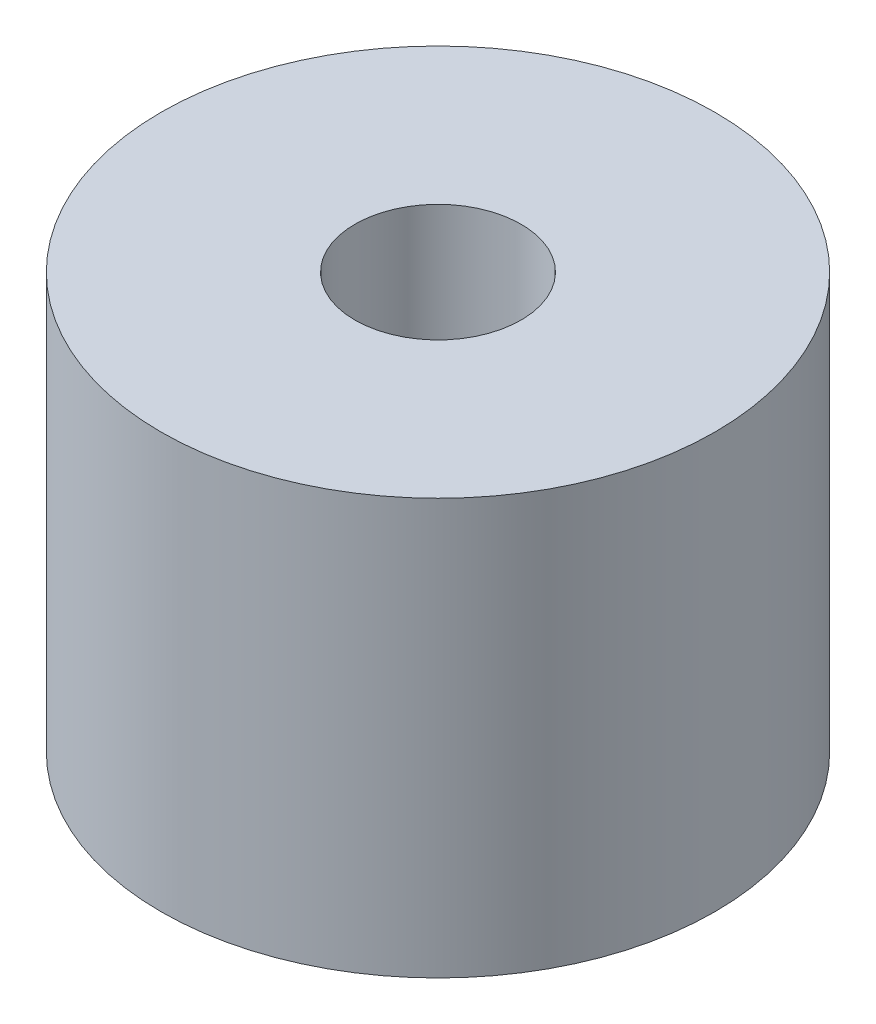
ISO-10303-21;
HEADER;
FILE_DESCRIPTION(('STEP AP214'),'2;1');
FILE_NAME('part.step','',(''),(''),'','','');
FILE_SCHEMA(('AUTOMOTIVE_DESIGN { 1 0 10303 214 1 1 1 1 }'));
ENDSEC;
DATA;
#1=APPLICATION_CONTEXT('core data for automotive mechanical design processes');
#2=APPLICATION_PROTOCOL_DEFINITION('international standard','automotive_design',2000,#1);
#3=PRODUCT_CONTEXT('',#1,'mechanical');
#4=PRODUCT('Part','Part','',(#3));
#5=PRODUCT_RELATED_PRODUCT_CATEGORY('part','',(#4));
#6=PRODUCT_DEFINITION_FORMATION('','',#4);
#7=PRODUCT_DEFINITION_CONTEXT('part definition',#1,'design');
#8=PRODUCT_DEFINITION('design','',#6,#7);
#9=PRODUCT_DEFINITION_SHAPE('','',#8);
#10=(LENGTH_UNIT() NAMED_UNIT(*) SI_UNIT(.MILLI.,.METRE.));
#11=(NAMED_UNIT(*) PLANE_ANGLE_UNIT() SI_UNIT($,.RADIAN.));
#12=(NAMED_UNIT(*) SI_UNIT($,.STERADIAN.) SOLID_ANGLE_UNIT());
#13=UNCERTAINTY_MEASURE_WITH_UNIT(LENGTH_MEASURE(1.E-05),#10,'distance_accuracy_value','');
#14=(GEOMETRIC_REPRESENTATION_CONTEXT(3) GLOBAL_UNCERTAINTY_ASSIGNED_CONTEXT((#13)) GLOBAL_UNIT_ASSIGNED_CONTEXT((#10,
#11,#12)) REPRESENTATION_CONTEXT('',''));
#15=CARTESIAN_POINT('',(0.,0.,0.));
#16=DIRECTION('',(0.,0.,1.));
#17=DIRECTION('',(1.,0.,0.));
#18=AXIS2_PLACEMENT_3D('',#15,#16,#17);
#19=CARTESIAN_POINT('',(0.,15.,0.));
#20=DIRECTION('',(0.,-1.,0.));
#21=DIRECTION('',(0.,0.,-1.));
#22=AXIS2_PLACEMENT_3D('',#19,#20,#21);
#23=CYLINDRICAL_SURFACE('',#22,10.);
#24=CARTESIAN_POINT('',(0.,15.,0.));
#25=DIRECTION('',(0.,1.,0.));
#26=DIRECTION('',(0.,0.,1.));
#27=AXIS2_PLACEMENT_3D('',#24,#25,#26);
#28=CIRCLE('',#27,10.);
#29=CARTESIAN_POINT('',(0.,15.,10.));
#30=VERTEX_POINT('',#29);
#31=EDGE_CURVE('E10',#30,#30,#28,.T.);
#32=ORIENTED_EDGE('',*,*,#31,.F.);
#33=EDGE_LOOP('',(#32));
#34=FACE_BOUND('',#33,.T.);
#35=CARTESIAN_POINT('',(0.,0.,0.));
#36=DIRECTION('',(0.,1.,0.));
#37=DIRECTION('',(0.,0.,1.));
#38=AXIS2_PLACEMENT_3D('',#35,#36,#37);
#39=CIRCLE('',#38,10.);
#40=CARTESIAN_POINT('',(0.,0.,10.));
#41=VERTEX_POINT('',#40);
#42=EDGE_CURVE('E18',#41,#41,#39,.T.);
#43=ORIENTED_EDGE('',*,*,#42,.T.);
#44=EDGE_LOOP('',(#43));
#45=FACE_BOUND('',#44,.T.);
#46=ADVANCED_FACE('F15',(#34,#45),#23,.T.);
#47=CARTESIAN_POINT('',(0.,15.,0.));
#48=DIRECTION('',(0.,1.,0.));
#49=DIRECTION('',(0.,0.,1.));
#50=AXIS2_PLACEMENT_3D('',#47,#48,#49);
#51=PLANE('',#50);
#52=CARTESIAN_POINT('',(0.,15.,0.));
#53=DIRECTION('',(0.,1.,0.));
#54=DIRECTION('',(0.,0.,1.));
#55=AXIS2_PLACEMENT_3D('',#52,#53,#54);
#56=CIRCLE('',#55,3.);
#57=CARTESIAN_POINT('',(0.,15.,3.));
#58=VERTEX_POINT('',#57);
#59=EDGE_CURVE('E34',#58,#58,#56,.T.);
#60=ORIENTED_EDGE('',*,*,#59,.F.);
#61=EDGE_LOOP('',(#60));
#62=FACE_BOUND('',#61,.T.);
#63=ORIENTED_EDGE('',*,*,#31,.T.);
#64=EDGE_LOOP('',(#63));
#65=FACE_BOUND('',#64,.T.);
#66=ADVANCED_FACE('F42',(#62,#65),#51,.T.);
#67=CARTESIAN_POINT('',(0.,0.,0.));
#68=DIRECTION('',(0.,1.,0.));
#69=DIRECTION('',(0.,0.,1.));
#70=AXIS2_PLACEMENT_3D('',#67,#68,#69);
#71=PLANE('',#70);
#72=ORIENTED_EDGE('',*,*,#42,.F.);
#73=EDGE_LOOP('',(#72));
#74=FACE_BOUND('',#73,.T.);
#75=ADVANCED_FACE('F28',(#74),#71,.F.);
#76=CARTESIAN_POINT('',(0.,5.,0.));
#77=DIRECTION('',(0.,1.,0.));
#78=DIRECTION('',(0.,0.,1.));
#79=AXIS2_PLACEMENT_3D('',#76,#77,#78);
#80=CONICAL_SURFACE('',#79,3.,1.02974425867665);
#81=CARTESIAN_POINT('',(0.,3.19741814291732,0.));
#82=VERTEX_POINT('',#81);
#83=VERTEX_LOOP('',#82);
#84=FACE_BOUND('',#83,.T.);
#85=CARTESIAN_POINT('',(0.,5.,0.));
#86=DIRECTION('',(0.,1.,0.));
#87=DIRECTION('',(0.,0.,1.));
#88=AXIS2_PLACEMENT_3D('',#85,#86,#87);
#89=CIRCLE('',#88,3.);
#90=CARTESIAN_POINT('',(0.,5.,3.));
#91=VERTEX_POINT('',#90);
#92=EDGE_CURVE('E32',#91,#91,#89,.T.);
#93=ORIENTED_EDGE('',*,*,#92,.T.);
#94=EDGE_LOOP('',(#93));
#95=FACE_BOUND('',#94,.T.);
#96=ADVANCED_FACE('F24',(#84,#95),#80,.F.);
#97=CARTESIAN_POINT('',(0.,15.,0.));
#98=DIRECTION('',(0.,1.,0.));
#99=DIRECTION('',(0.,0.,1.));
#100=AXIS2_PLACEMENT_3D('',#97,#98,#99);
#101=CYLINDRICAL_SURFACE('',#100,3.);
#102=ORIENTED_EDGE('',*,*,#92,.F.);
#103=EDGE_LOOP('',(#102));
#104=FACE_BOUND('',#103,.T.);
#105=ORIENTED_EDGE('',*,*,#59,.T.);
#106=EDGE_LOOP('',(#105));
#107=FACE_BOUND('',#106,.T.);
#108=ADVANCED_FACE('F27',(#104,#107),#101,.F.);
#109=CLOSED_SHELL('',(#46,#66,#75,#96,#108));
#110=MANIFOLD_SOLID_BREP('B1',#109);
#111=ADVANCED_BREP_SHAPE_REPRESENTATION('',(#18,#110),#14);
#112=SHAPE_DEFINITION_REPRESENTATION(#9,#111);
ENDSEC;
END-ISO-10303-21;
